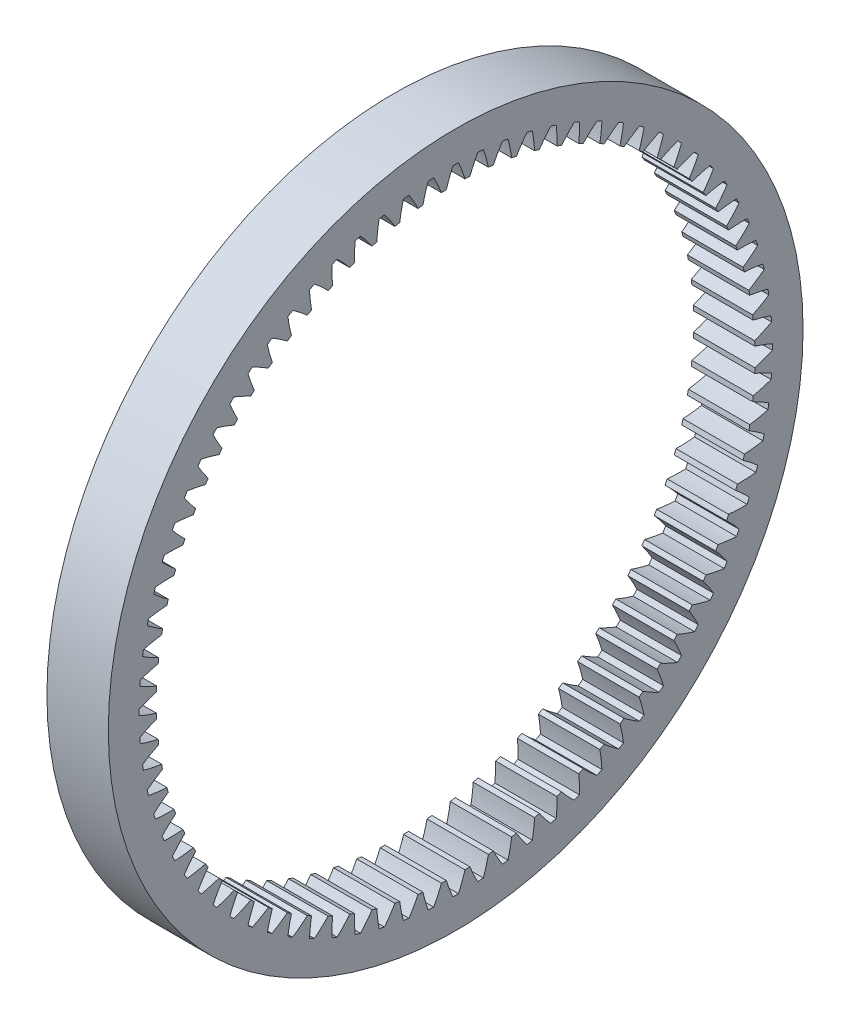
from build123d import *

# Parameters (mm, degrees)
BASPROSKE_W         = 20
BASPROSKE_H         = 5.6514
TOOTHCUT_DEPTH      = 148.242733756
TEETHCUTS_COUNT     = 80
TEETHCUTS_ANGLE     = 355.5
SKETCH1_R           = 113.1514
SKETCH1_R_2         = 103.1514
EXTRUDE_THIN1_DEPTH = 20
SCALE1_SCALE        = 0.6


with BuildPart() as part:
    # BasProSke → Base-Revolve (revolve)
    with BuildSketch(Plane(origin=(0, 0, 0), x_dir=(1, 0, 0), z_dir=(0, 1, 0)), mode=Mode.PRIVATE) as base_revolve_sk:
        with Locations((10, 100.3257)):
            Rectangle(BASPROSKE_W, BASPROSKE_H)
    revolve(base_revolve_sk.sketch.rotate(Axis((-10, 0, 0), (1, 0, 0)), 180), axis=Axis((-10, 0, 0), (1, 0, 0)))

    # TooCutSke → ToothCut (cut, through all)
    with BuildSketch(Plane(origin=(0, 0, 0), x_dir=(0, 0, -1), z_dir=(1, 0, 0))):
        with BuildLine():
            ThreePointArc((3.03159073, 97.427445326), (2.059205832, 100.306897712), (0.913673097, 103.121952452))
            ThreePointArc((0.913673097, 103.121952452), (0, 103.126), (-0.913673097, 103.121952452))
            ThreePointArc((-0.913673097, 103.121952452), (-2.059205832, 100.306897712), (-3.03159073, 97.427445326))
            ThreePointArc((-3.03159073, 97.427445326), (0, 97.4746), (3.03159073, 97.427445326))
        make_face()
    toothcut = extrude(amount=TOOTHCUT_DEPTH, mode=Mode.SUBTRACT)

    # TeethCuts: ToothCut ×80 about axis
    teethcuts_axis = Axis((-10, 0, 0), (1, 0, 0))
    for i in range(1, TEETHCUTS_COUNT):
        add(toothcut.rotate(teethcuts_axis, i * TEETHCUTS_ANGLE / (TEETHCUTS_COUNT - 1)), mode=Mode.SUBTRACT)

    # Sketch1 → Extrude-Thin1 (add)
    with BuildSketch(Plane(origin=(20, 0, 0), x_dir=(0, 0, -1), z_dir=(1, 0, 0))):
        Circle(SKETCH1_R)
        Circle(SKETCH1_R_2, mode=Mode.SUBTRACT)
    extrude(amount=-EXTRUDE_THIN1_DEPTH)


with BuildPart() as part_1:
    # Scale1: scaled about (10, 0, 0)
    add(part.part.scale(SCALE1_SCALE).moved(Location((4, 0, 0))))


solid = part_1.part
